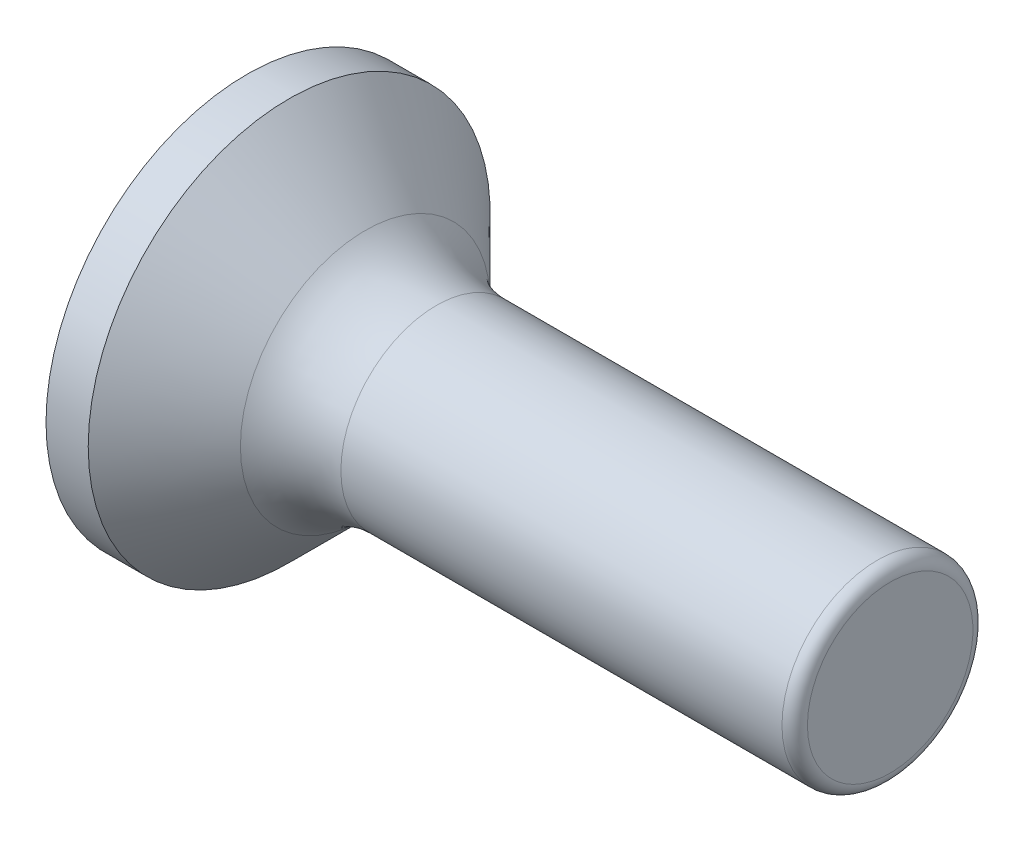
ISO-10303-21;
HEADER;
FILE_DESCRIPTION(('STEP AP214'),'2;1');
FILE_NAME('part.step','',(''),(''),'','','');
FILE_SCHEMA(('AUTOMOTIVE_DESIGN { 1 0 10303 214 1 1 1 1 }'));
ENDSEC;
DATA;
#1=APPLICATION_CONTEXT('core data for automotive mechanical design processes');
#2=APPLICATION_PROTOCOL_DEFINITION('international standard','automotive_design',2000,#1);
#3=PRODUCT_CONTEXT('',#1,'mechanical');
#4=PRODUCT('Part','Part','',(#3));
#5=PRODUCT_RELATED_PRODUCT_CATEGORY('part','',(#4));
#6=PRODUCT_DEFINITION_FORMATION('','',#4);
#7=PRODUCT_DEFINITION_CONTEXT('part definition',#1,'design');
#8=PRODUCT_DEFINITION('design','',#6,#7);
#9=PRODUCT_DEFINITION_SHAPE('','',#8);
#10=(LENGTH_UNIT() NAMED_UNIT(*) SI_UNIT(.MILLI.,.METRE.));
#11=(NAMED_UNIT(*) PLANE_ANGLE_UNIT() SI_UNIT($,.RADIAN.));
#12=(NAMED_UNIT(*) SI_UNIT($,.STERADIAN.) SOLID_ANGLE_UNIT());
#13=UNCERTAINTY_MEASURE_WITH_UNIT(LENGTH_MEASURE(1.E-05),#10,'distance_accuracy_value','');
#14=(GEOMETRIC_REPRESENTATION_CONTEXT(3) GLOBAL_UNCERTAINTY_ASSIGNED_CONTEXT((#13)) GLOBAL_UNIT_ASSIGNED_CONTEXT((#10,
#11,#12)) REPRESENTATION_CONTEXT('',''));
#15=CARTESIAN_POINT('',(0.,0.,0.));
#16=DIRECTION('',(0.,0.,1.));
#17=DIRECTION('',(1.,0.,0.));
#18=AXIS2_PLACEMENT_3D('',#15,#16,#17);
#19=CARTESIAN_POINT('',(0.,10.,0.));
#20=DIRECTION('',(1.,0.,0.));
#21=DIRECTION('',(0.,0.,-1.));
#22=AXIS2_PLACEMENT_3D('',#19,#20,#21);
#23=PLANE('',#22);
#24=CARTESIAN_POINT('',(0.,0.,0.));
#25=DIRECTION('',(-1.,0.,0.));
#26=DIRECTION('',(0.,0.,1.));
#27=AXIS2_PLACEMENT_3D('',#24,#25,#26);
#28=CIRCLE('',#27,10.);
#29=CARTESIAN_POINT('',(0.,0.,10.));
#30=VERTEX_POINT('',#29);
#31=EDGE_CURVE('E182',#30,#30,#28,.T.);
#32=ORIENTED_EDGE('',*,*,#31,.T.);
#33=EDGE_LOOP('',(#32));
#34=FACE_BOUND('',#33,.T.);
#35=DIRECTION('',(0.,-1.,0.));
#36=VECTOR('',#35,1.);
#37=CARTESIAN_POINT('',(0.,5.,1.));
#38=LINE('',#37,#36);
#39=CARTESIAN_POINT('',(0.,5.,1.));
#40=VERTEX_POINT('',#39);
#41=CARTESIAN_POINT('',(0.,1.,1.));
#42=VERTEX_POINT('',#41);
#43=EDGE_CURVE('E54',#40,#42,#38,.T.);
#44=ORIENTED_EDGE('',*,*,#43,.T.);
#45=DIRECTION('',(0.,0.,1.));
#46=VECTOR('',#45,1.);
#47=CARTESIAN_POINT('',(0.,1.,1.));
#48=LINE('',#47,#46);
#49=CARTESIAN_POINT('',(0.,1.,5.));
#50=VERTEX_POINT('',#49);
#51=EDGE_CURVE('E271',#42,#50,#48,.T.);
#52=ORIENTED_EDGE('',*,*,#51,.T.);
#53=DIRECTION('',(0.,-1.,0.));
#54=VECTOR('',#53,1.);
#55=CARTESIAN_POINT('',(0.,1.,5.));
#56=LINE('',#55,#54);
#57=CARTESIAN_POINT('',(0.,-1.,5.));
#58=VERTEX_POINT('',#57);
#59=EDGE_CURVE('E273',#50,#58,#56,.T.);
#60=ORIENTED_EDGE('',*,*,#59,.T.);
#61=DIRECTION('',(0.,0.,-1.));
#62=VECTOR('',#61,1.);
#63=CARTESIAN_POINT('',(0.,-1.,1.));
#64=LINE('',#63,#62);
#65=CARTESIAN_POINT('',(0.,-1.,1.));
#66=VERTEX_POINT('',#65);
#67=EDGE_CURVE('E279',#58,#66,#64,.T.);
#68=ORIENTED_EDGE('',*,*,#67,.T.);
#69=DIRECTION('',(0.,-1.,0.));
#70=VECTOR('',#69,1.);
#71=CARTESIAN_POINT('',(0.,-5.,1.));
#72=LINE('',#71,#70);
#73=CARTESIAN_POINT('',(0.,-5.,1.));
#74=VERTEX_POINT('',#73);
#75=EDGE_CURVE('E282',#66,#74,#72,.T.);
#76=ORIENTED_EDGE('',*,*,#75,.T.);
#77=DIRECTION('',(0.,0.,-1.));
#78=VECTOR('',#77,1.);
#79=CARTESIAN_POINT('',(0.,-5.,-1.));
#80=LINE('',#79,#78);
#81=CARTESIAN_POINT('',(0.,-5.,-1.));
#82=VERTEX_POINT('',#81);
#83=EDGE_CURVE('E285',#74,#82,#80,.T.);
#84=ORIENTED_EDGE('',*,*,#83,.T.);
#85=DIRECTION('',(0.,1.,0.));
#86=VECTOR('',#85,1.);
#87=CARTESIAN_POINT('',(0.,-5.,-1.));
#88=LINE('',#87,#86);
#89=CARTESIAN_POINT('',(0.,-1.,-1.));
#90=VERTEX_POINT('',#89);
#91=EDGE_CURVE('E288',#82,#90,#88,.T.);
#92=ORIENTED_EDGE('',*,*,#91,.T.);
#93=DIRECTION('',(0.,0.,-1.));
#94=VECTOR('',#93,1.);
#95=CARTESIAN_POINT('',(0.,-1.,-1.));
#96=LINE('',#95,#94);
#97=CARTESIAN_POINT('',(0.,-1.,-5.));
#98=VERTEX_POINT('',#97);
#99=EDGE_CURVE('E162',#90,#98,#96,.T.);
#100=ORIENTED_EDGE('',*,*,#99,.T.);
#101=DIRECTION('',(0.,1.,0.));
#102=VECTOR('',#101,1.);
#103=CARTESIAN_POINT('',(0.,1.,-5.));
#104=LINE('',#103,#102);
#105=CARTESIAN_POINT('',(0.,1.,-5.));
#106=VERTEX_POINT('',#105);
#107=EDGE_CURVE('E160',#98,#106,#104,.T.);
#108=ORIENTED_EDGE('',*,*,#107,.T.);
#109=DIRECTION('',(0.,0.,1.));
#110=VECTOR('',#109,1.);
#111=CARTESIAN_POINT('',(0.,1.,-1.));
#112=LINE('',#111,#110);
#113=CARTESIAN_POINT('',(0.,1.,-1.));
#114=VERTEX_POINT('',#113);
#115=EDGE_CURVE('E140',#106,#114,#112,.T.);
#116=ORIENTED_EDGE('',*,*,#115,.T.);
#117=DIRECTION('',(0.,1.,0.));
#118=VECTOR('',#117,1.);
#119=CARTESIAN_POINT('',(0.,5.,-1.));
#120=LINE('',#119,#118);
#121=CARTESIAN_POINT('',(0.,5.,-1.));
#122=VERTEX_POINT('',#121);
#123=EDGE_CURVE('E150',#114,#122,#120,.T.);
#124=ORIENTED_EDGE('',*,*,#123,.T.);
#125=DIRECTION('',(0.,0.,1.));
#126=VECTOR('',#125,1.);
#127=CARTESIAN_POINT('',(0.,5.,-1.));
#128=LINE('',#127,#126);
#129=EDGE_CURVE('E156',#122,#40,#128,.T.);
#130=ORIENTED_EDGE('',*,*,#129,.T.);
#131=EDGE_LOOP('',(#44,#52,#60,#68,#76,#84,#92,#100,#108,#116,#124,#130));
#132=FACE_BOUND('',#131,.T.);
#133=ADVANCED_FACE('F37',(#34,#132),#23,.F.);
#134=CARTESIAN_POINT('',(9.42106781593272,0.,0.));
#135=DIRECTION('',(-1.,0.,0.));
#136=DIRECTION('',(0.,0.,1.));
#137=AXIS2_PLACEMENT_3D('',#134,#135,#136);
#138=TOROIDAL_SURFACE('',#137,9.75,5.00000000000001);
#139=CARTESIAN_POINT('',(5.88553391,0.,0.));
#140=DIRECTION('',(-1.,0.,0.));
#141=DIRECTION('',(0.,0.,1.));
#142=AXIS2_PLACEMENT_3D('',#139,#140,#141);
#143=CIRCLE('',#142,6.21446609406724);
#144=CARTESIAN_POINT('',(5.88553391,0.,6.21446609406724));
#145=VERTEX_POINT('',#144);
#146=EDGE_CURVE('E188',#145,#145,#143,.T.);
#147=ORIENTED_EDGE('',*,*,#146,.F.);
#148=EDGE_LOOP('',(#147));
#149=FACE_BOUND('',#148,.T.);
#150=CARTESIAN_POINT('',(9.42106781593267,0.,0.));
#151=DIRECTION('',(-1.,0.,0.));
#152=DIRECTION('',(0.,0.,1.));
#153=AXIS2_PLACEMENT_3D('',#150,#151,#152);
#154=CIRCLE('',#153,4.74999999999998);
#155=CARTESIAN_POINT('',(9.42106781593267,0.,4.74999999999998));
#156=VERTEX_POINT('',#155);
#157=EDGE_CURVE('E178',#156,#156,#154,.T.);
#158=ORIENTED_EDGE('',*,*,#157,.T.);
#159=EDGE_LOOP('',(#158));
#160=FACE_BOUND('',#159,.T.);
#161=ADVANCED_FACE('F227',(#149,#160),#138,.F.);
#162=CARTESIAN_POINT('',(5.88553391,0.,0.));
#163=DIRECTION('',(-1.,0.,0.));
#164=DIRECTION('',(0.,0.,1.));
#165=AXIS2_PLACEMENT_3D('',#162,#163,#164);
#166=CONICAL_SURFACE('',#165,6.21446609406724,0.785398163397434);
#167=CARTESIAN_POINT('',(2.10000000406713,0.,0.));
#168=DIRECTION('',(-1.,0.,0.));
#169=DIRECTION('',(0.,0.,1.));
#170=AXIS2_PLACEMENT_3D('',#167,#168,#169);
#171=CIRCLE('',#170,10.);
#172=CARTESIAN_POINT('',(2.10000000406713,0.,10.));
#173=VERTEX_POINT('',#172);
#174=EDGE_CURVE('E185',#173,#173,#171,.T.);
#175=ORIENTED_EDGE('',*,*,#174,.F.);
#176=EDGE_LOOP('',(#175));
#177=FACE_BOUND('',#176,.T.);
#178=ORIENTED_EDGE('',*,*,#146,.T.);
#179=EDGE_LOOP('',(#178));
#180=FACE_BOUND('',#179,.T.);
#181=ADVANCED_FACE('F233',(#177,#180),#166,.T.);
#182=CARTESIAN_POINT('',(-11.6961475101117,0.,0.));
#183=DIRECTION('',(-1.,0.,0.));
#184=DIRECTION('',(0.,0.,1.));
#185=AXIS2_PLACEMENT_3D('',#182,#183,#184);
#186=CYLINDRICAL_SURFACE('',#185,10.);
#187=ORIENTED_EDGE('',*,*,#31,.F.);
#188=EDGE_LOOP('',(#187));
#189=FACE_BOUND('',#188,.T.);
#190=ORIENTED_EDGE('',*,*,#174,.T.);
#191=EDGE_LOOP('',(#190));
#192=FACE_BOUND('',#191,.T.);
#193=ADVANCED_FACE('F240',(#189,#192),#186,.T.);
#194=CARTESIAN_POINT('',(32.,0.,0.));
#195=DIRECTION('',(-1.,0.,0.));
#196=DIRECTION('',(0.,0.,1.));
#197=AXIS2_PLACEMENT_3D('',#194,#195,#196);
#198=PLANE('',#197);
#199=CARTESIAN_POINT('',(32.,0.,0.));
#200=DIRECTION('',(-1.,0.,0.));
#201=DIRECTION('',(0.,0.,1.));
#202=AXIS2_PLACEMENT_3D('',#199,#200,#201);
#203=CIRCLE('',#202,4.11666666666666);
#204=CARTESIAN_POINT('',(32.,0.,4.11666666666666));
#205=VERTEX_POINT('',#204);
#206=EDGE_CURVE('E11',#205,#205,#203,.F.);
#207=ORIENTED_EDGE('',*,*,#206,.T.);
#208=EDGE_LOOP('',(#207));
#209=FACE_BOUND('',#208,.T.);
#210=ADVANCED_FACE('F238',(#209),#198,.F.);
#211=CARTESIAN_POINT('',(-11.6961475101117,0.,0.));
#212=DIRECTION('',(-1.,0.,0.));
#213=DIRECTION('',(0.,0.,1.));
#214=AXIS2_PLACEMENT_3D('',#211,#212,#213);
#215=CYLINDRICAL_SURFACE('',#214,4.74999999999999);
#216=CARTESIAN_POINT('',(31.3666666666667,0.,0.));
#217=DIRECTION('',(-1.,0.,0.));
#218=DIRECTION('',(0.,0.,1.));
#219=AXIS2_PLACEMENT_3D('',#216,#217,#218);
#220=CIRCLE('',#219,4.74999999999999);
#221=CARTESIAN_POINT('',(31.3666666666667,0.,4.74999999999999));
#222=VERTEX_POINT('',#221);
#223=EDGE_CURVE('E46',#222,#222,#220,.T.);
#224=ORIENTED_EDGE('',*,*,#223,.T.);
#225=EDGE_LOOP('',(#224));
#226=FACE_BOUND('',#225,.T.);
#227=ORIENTED_EDGE('',*,*,#157,.F.);
#228=EDGE_LOOP('',(#227));
#229=FACE_BOUND('',#228,.T.);
#230=ADVANCED_FACE('F214',(#226,#229),#215,.T.);
#231=CARTESIAN_POINT('',(2.942766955,5.,1.));
#232=DIRECTION('',(0.,0.,-1.));
#233=DIRECTION('',(-1.,0.,0.));
#234=AXIS2_PLACEMENT_3D('',#231,#232,#233);
#235=PLANE('',#234);
#236=ORIENTED_EDGE('',*,*,#43,.F.);
#237=DIRECTION('',(-0.866025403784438,0.500000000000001,0.));
#238=VECTOR('',#237,1.);
#239=CARTESIAN_POINT('',(2.20707521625,3.72574452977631,1.));
#240=LINE('',#239,#238);
#241=CARTESIAN_POINT('',(2.942766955,3.30099270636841,1.));
#242=VERTEX_POINT('',#241);
#243=EDGE_CURVE('E196',#242,#40,#240,.T.);
#244=ORIENTED_EDGE('',*,*,#243,.F.);
#245=DIRECTION('',(0.,-1.,0.));
#246=VECTOR('',#245,1.);
#247=CARTESIAN_POINT('',(2.942766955,5.,1.));
#248=LINE('',#247,#246);
#249=CARTESIAN_POINT('',(2.942766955,1.,1.));
#250=VERTEX_POINT('',#249);
#251=EDGE_CURVE('E166',#242,#250,#248,.T.);
#252=ORIENTED_EDGE('',*,*,#251,.T.);
#253=DIRECTION('',(-1.,0.,0.));
#254=VECTOR('',#253,1.);
#255=CARTESIAN_POINT('',(2.942766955,1.,1.));
#256=LINE('',#255,#254);
#257=EDGE_CURVE('E176',#250,#42,#256,.T.);
#258=ORIENTED_EDGE('',*,*,#257,.T.);
#259=EDGE_LOOP('',(#236,#244,#252,#258));
#260=FACE_BOUND('',#259,.T.);
#261=ADVANCED_FACE('F303',(#260),#235,.T.);
#262=CARTESIAN_POINT('',(2.942766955,1.,1.));
#263=DIRECTION('',(0.,-1.,0.));
#264=DIRECTION('',(0.,0.,-1.));
#265=AXIS2_PLACEMENT_3D('',#262,#263,#264);
#266=PLANE('',#265);
#267=ORIENTED_EDGE('',*,*,#51,.F.);
#268=ORIENTED_EDGE('',*,*,#257,.F.);
#269=DIRECTION('',(0.,0.,1.));
#270=VECTOR('',#269,1.);
#271=CARTESIAN_POINT('',(2.942766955,1.,1.));
#272=LINE('',#271,#270);
#273=CARTESIAN_POINT('',(2.942766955,1.,3.30099270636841));
#274=VERTEX_POINT('',#273);
#275=EDGE_CURVE('E95',#250,#274,#272,.T.);
#276=ORIENTED_EDGE('',*,*,#275,.T.);
#277=DIRECTION('',(-0.866025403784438,0.,0.500000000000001));
#278=VECTOR('',#277,1.);
#279=CARTESIAN_POINT('',(0.,1.,5.));
#280=LINE('',#279,#278);
#281=EDGE_CURVE('E179',#274,#50,#280,.T.);
#282=ORIENTED_EDGE('',*,*,#281,.T.);
#283=EDGE_LOOP('',(#267,#268,#276,#282));
#284=FACE_BOUND('',#283,.T.);
#285=ADVANCED_FACE('F256',(#284),#266,.T.);
#286=CARTESIAN_POINT('',(0.,1.,5.));
#287=DIRECTION('',(-0.500000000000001,0.,-0.866025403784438));
#288=DIRECTION('',(-0.866025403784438,0.,0.500000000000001));
#289=AXIS2_PLACEMENT_3D('',#286,#287,#288);
#290=PLANE('',#289);
#291=ORIENTED_EDGE('',*,*,#59,.F.);
#292=ORIENTED_EDGE('',*,*,#281,.F.);
#293=DIRECTION('',(0.,-1.,0.));
#294=VECTOR('',#293,1.);
#295=CARTESIAN_POINT('',(2.942766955,1.,3.30099270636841));
#296=LINE('',#295,#294);
#297=CARTESIAN_POINT('',(2.942766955,-1.,3.30099270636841));
#298=VERTEX_POINT('',#297);
#299=EDGE_CURVE('E85',#274,#298,#296,.T.);
#300=ORIENTED_EDGE('',*,*,#299,.T.);
#301=DIRECTION('',(-0.866025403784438,0.,0.500000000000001));
#302=VECTOR('',#301,1.);
#303=CARTESIAN_POINT('',(3.93912602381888,-1.,2.7257445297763));
#304=LINE('',#303,#302);
#305=EDGE_CURVE('E174',#298,#58,#304,.T.);
#306=ORIENTED_EDGE('',*,*,#305,.T.);
#307=EDGE_LOOP('',(#291,#292,#300,#306));
#308=FACE_BOUND('',#307,.T.);
#309=ADVANCED_FACE('F252',(#308),#290,.T.);
#310=CARTESIAN_POINT('',(2.942766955,-1.,1.));
#311=DIRECTION('',(0.,1.,0.));
#312=DIRECTION('',(0.,0.,1.));
#313=AXIS2_PLACEMENT_3D('',#310,#311,#312);
#314=PLANE('',#313);
#315=ORIENTED_EDGE('',*,*,#67,.F.);
#316=ORIENTED_EDGE('',*,*,#305,.F.);
#317=DIRECTION('',(0.,0.,-1.));
#318=VECTOR('',#317,1.);
#319=CARTESIAN_POINT('',(2.942766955,-1.,1.));
#320=LINE('',#319,#318);
#321=CARTESIAN_POINT('',(2.942766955,-1.,1.));
#322=VERTEX_POINT('',#321);
#323=EDGE_CURVE('E210',#298,#322,#320,.T.);
#324=ORIENTED_EDGE('',*,*,#323,.T.);
#325=DIRECTION('',(-1.,0.,0.));
#326=VECTOR('',#325,1.);
#327=CARTESIAN_POINT('',(2.942766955,-1.,1.));
#328=LINE('',#327,#326);
#329=EDGE_CURVE('E172',#322,#66,#328,.T.);
#330=ORIENTED_EDGE('',*,*,#329,.T.);
#331=EDGE_LOOP('',(#315,#316,#324,#330));
#332=FACE_BOUND('',#331,.T.);
#333=ADVANCED_FACE('F255',(#332),#314,.T.);
#334=CARTESIAN_POINT('',(2.942766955,-5.,1.));
#335=DIRECTION('',(0.,0.,-1.));
#336=DIRECTION('',(-1.,0.,0.));
#337=AXIS2_PLACEMENT_3D('',#334,#335,#336);
#338=PLANE('',#337);
#339=ORIENTED_EDGE('',*,*,#75,.F.);
#340=ORIENTED_EDGE('',*,*,#329,.F.);
#341=DIRECTION('',(0.,-1.,0.));
#342=VECTOR('',#341,1.);
#343=CARTESIAN_POINT('',(2.942766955,-5.,1.));
#344=LINE('',#343,#342);
#345=CARTESIAN_POINT('',(2.942766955,-3.30099270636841,1.));
#346=VERTEX_POINT('',#345);
#347=EDGE_CURVE('E206',#322,#346,#344,.T.);
#348=ORIENTED_EDGE('',*,*,#347,.T.);
#349=DIRECTION('',(-0.866025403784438,-0.500000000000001,0.));
#350=VECTOR('',#349,1.);
#351=CARTESIAN_POINT('',(0.,-5.,1.));
#352=LINE('',#351,#350);
#353=EDGE_CURVE('E175',#346,#74,#352,.T.);
#354=ORIENTED_EDGE('',*,*,#353,.T.);
#355=EDGE_LOOP('',(#339,#340,#348,#354));
#356=FACE_BOUND('',#355,.T.);
#357=ADVANCED_FACE('F260',(#356),#338,.T.);
#358=CARTESIAN_POINT('',(0.,-5.,-1.));
#359=DIRECTION('',(-0.500000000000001,0.866025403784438,0.));
#360=DIRECTION('',(-0.866025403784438,-0.500000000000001,0.));
#361=AXIS2_PLACEMENT_3D('',#358,#359,#360);
#362=PLANE('',#361);
#363=ORIENTED_EDGE('',*,*,#83,.F.);
#364=ORIENTED_EDGE('',*,*,#353,.F.);
#365=DIRECTION('',(0.,0.,-1.));
#366=VECTOR('',#365,1.);
#367=CARTESIAN_POINT('',(2.942766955,-3.30099270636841,1.));
#368=LINE('',#367,#366);
#369=CARTESIAN_POINT('',(2.942766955,-3.30099270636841,-1.));
#370=VERTEX_POINT('',#369);
#371=EDGE_CURVE('E203',#346,#370,#368,.T.);
#372=ORIENTED_EDGE('',*,*,#371,.T.);
#373=DIRECTION('',(-0.866025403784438,-0.500000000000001,0.));
#374=VECTOR('',#373,1.);
#375=CARTESIAN_POINT('',(2.20707521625,-3.72574452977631,-1.));
#376=LINE('',#375,#374);
#377=EDGE_CURVE('E170',#370,#82,#376,.T.);
#378=ORIENTED_EDGE('',*,*,#377,.T.);
#379=EDGE_LOOP('',(#363,#364,#372,#378));
#380=FACE_BOUND('',#379,.T.);
#381=ADVANCED_FACE('F257',(#380),#362,.T.);
#382=CARTESIAN_POINT('',(2.942766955,-5.,-1.));
#383=DIRECTION('',(0.,0.,1.));
#384=DIRECTION('',(0.,-1.,0.));
#385=AXIS2_PLACEMENT_3D('',#382,#383,#384);
#386=PLANE('',#385);
#387=ORIENTED_EDGE('',*,*,#91,.F.);
#388=ORIENTED_EDGE('',*,*,#377,.F.);
#389=DIRECTION('',(0.,1.,0.));
#390=VECTOR('',#389,1.);
#391=CARTESIAN_POINT('',(2.942766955,-5.,-1.));
#392=LINE('',#391,#390);
#393=CARTESIAN_POINT('',(2.942766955,-1.,-1.));
#394=VERTEX_POINT('',#393);
#395=EDGE_CURVE('E205',#370,#394,#392,.T.);
#396=ORIENTED_EDGE('',*,*,#395,.T.);
#397=DIRECTION('',(-1.,0.,0.));
#398=VECTOR('',#397,1.);
#399=CARTESIAN_POINT('',(2.942766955,-1.,-1.));
#400=LINE('',#399,#398);
#401=EDGE_CURVE('E168',#394,#90,#400,.T.);
#402=ORIENTED_EDGE('',*,*,#401,.T.);
#403=EDGE_LOOP('',(#387,#388,#396,#402));
#404=FACE_BOUND('',#403,.T.);
#405=ADVANCED_FACE('F259',(#404),#386,.T.);
#406=CARTESIAN_POINT('',(2.942766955,-1.,-1.));
#407=DIRECTION('',(0.,1.,0.));
#408=DIRECTION('',(0.,0.,1.));
#409=AXIS2_PLACEMENT_3D('',#406,#407,#408);
#410=PLANE('',#409);
#411=ORIENTED_EDGE('',*,*,#99,.F.);
#412=ORIENTED_EDGE('',*,*,#401,.F.);
#413=DIRECTION('',(0.,0.,-1.));
#414=VECTOR('',#413,1.);
#415=CARTESIAN_POINT('',(2.942766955,-1.,-1.));
#416=LINE('',#415,#414);
#417=CARTESIAN_POINT('',(2.942766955,-1.,-3.30099270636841));
#418=VERTEX_POINT('',#417);
#419=EDGE_CURVE('E194',#394,#418,#416,.T.);
#420=ORIENTED_EDGE('',*,*,#419,.T.);
#421=DIRECTION('',(-0.866025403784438,0.,-0.500000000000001));
#422=VECTOR('',#421,1.);
#423=CARTESIAN_POINT('',(0.,-1.,-5.));
#424=LINE('',#423,#422);
#425=EDGE_CURVE('E171',#418,#98,#424,.T.);
#426=ORIENTED_EDGE('',*,*,#425,.T.);
#427=EDGE_LOOP('',(#411,#412,#420,#426));
#428=FACE_BOUND('',#427,.T.);
#429=ADVANCED_FACE('F250',(#428),#410,.T.);
#430=CARTESIAN_POINT('',(0.,1.,-5.));
#431=DIRECTION('',(-0.500000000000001,0.,0.866025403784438));
#432=DIRECTION('',(0.866025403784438,0.,0.500000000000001));
#433=AXIS2_PLACEMENT_3D('',#430,#431,#432);
#434=PLANE('',#433);
#435=ORIENTED_EDGE('',*,*,#107,.F.);
#436=ORIENTED_EDGE('',*,*,#425,.F.);
#437=DIRECTION('',(0.,1.,0.));
#438=VECTOR('',#437,1.);
#439=CARTESIAN_POINT('',(2.942766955,1.,-3.30099270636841));
#440=LINE('',#439,#438);
#441=CARTESIAN_POINT('',(2.942766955,1.,-3.30099270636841));
#442=VERTEX_POINT('',#441);
#443=EDGE_CURVE('E192',#418,#442,#440,.T.);
#444=ORIENTED_EDGE('',*,*,#443,.T.);
#445=DIRECTION('',(-0.866025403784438,0.,-0.500000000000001));
#446=VECTOR('',#445,1.);
#447=CARTESIAN_POINT('',(3.93912602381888,1.,-2.72574452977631));
#448=LINE('',#447,#446);
#449=EDGE_CURVE('E146',#442,#106,#448,.T.);
#450=ORIENTED_EDGE('',*,*,#449,.T.);
#451=EDGE_LOOP('',(#435,#436,#444,#450));
#452=FACE_BOUND('',#451,.T.);
#453=ADVANCED_FACE('F247',(#452),#434,.T.);
#454=CARTESIAN_POINT('',(2.942766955,1.,-1.));
#455=DIRECTION('',(0.,-1.,0.));
#456=DIRECTION('',(0.,0.,-1.));
#457=AXIS2_PLACEMENT_3D('',#454,#455,#456);
#458=PLANE('',#457);
#459=ORIENTED_EDGE('',*,*,#115,.F.);
#460=ORIENTED_EDGE('',*,*,#449,.F.);
#461=DIRECTION('',(0.,0.,1.));
#462=VECTOR('',#461,1.);
#463=CARTESIAN_POINT('',(2.942766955,1.,-1.));
#464=LINE('',#463,#462);
#465=CARTESIAN_POINT('',(2.942766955,1.,-1.));
#466=VERTEX_POINT('',#465);
#467=EDGE_CURVE('E143',#442,#466,#464,.T.);
#468=ORIENTED_EDGE('',*,*,#467,.T.);
#469=DIRECTION('',(-1.,0.,0.));
#470=VECTOR('',#469,1.);
#471=CARTESIAN_POINT('',(2.942766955,1.,-1.));
#472=LINE('',#471,#470);
#473=EDGE_CURVE('E135',#466,#114,#472,.T.);
#474=ORIENTED_EDGE('',*,*,#473,.T.);
#475=EDGE_LOOP('',(#459,#460,#468,#474));
#476=FACE_BOUND('',#475,.T.);
#477=ADVANCED_FACE('F137',(#476),#458,.T.);
#478=CARTESIAN_POINT('',(2.942766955,5.,-1.));
#479=DIRECTION('',(0.,0.,1.));
#480=DIRECTION('',(0.,-1.,0.));
#481=AXIS2_PLACEMENT_3D('',#478,#479,#480);
#482=PLANE('',#481);
#483=ORIENTED_EDGE('',*,*,#123,.F.);
#484=ORIENTED_EDGE('',*,*,#473,.F.);
#485=DIRECTION('',(0.,1.,0.));
#486=VECTOR('',#485,1.);
#487=CARTESIAN_POINT('',(2.942766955,5.,-1.));
#488=LINE('',#487,#486);
#489=CARTESIAN_POINT('',(2.942766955,3.30099270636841,-1.));
#490=VERTEX_POINT('',#489);
#491=EDGE_CURVE('E200',#466,#490,#488,.T.);
#492=ORIENTED_EDGE('',*,*,#491,.T.);
#493=DIRECTION('',(-0.866025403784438,0.500000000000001,0.));
#494=VECTOR('',#493,1.);
#495=CARTESIAN_POINT('',(0.,5.,-1.));
#496=LINE('',#495,#494);
#497=EDGE_CURVE('E147',#490,#122,#496,.T.);
#498=ORIENTED_EDGE('',*,*,#497,.T.);
#499=EDGE_LOOP('',(#483,#484,#492,#498));
#500=FACE_BOUND('',#499,.T.);
#501=ADVANCED_FACE('F151',(#500),#482,.T.);
#502=CARTESIAN_POINT('',(0.,5.,-1.));
#503=DIRECTION('',(-0.500000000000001,-0.866025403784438,0.));
#504=DIRECTION('',(0.866025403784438,-0.500000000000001,0.));
#505=AXIS2_PLACEMENT_3D('',#502,#503,#504);
#506=PLANE('',#505);
#507=ORIENTED_EDGE('',*,*,#129,.F.);
#508=ORIENTED_EDGE('',*,*,#497,.F.);
#509=DIRECTION('',(0.,0.,1.));
#510=VECTOR('',#509,1.);
#511=CARTESIAN_POINT('',(2.942766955,3.30099270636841,1.));
#512=LINE('',#511,#510);
#513=EDGE_CURVE('E198',#490,#242,#512,.T.);
#514=ORIENTED_EDGE('',*,*,#513,.T.);
#515=ORIENTED_EDGE('',*,*,#243,.T.);
#516=EDGE_LOOP('',(#507,#508,#514,#515));
#517=FACE_BOUND('',#516,.T.);
#518=ADVANCED_FACE('F223',(#517),#506,.T.);
#519=CARTESIAN_POINT('',(2.942766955,1.,1.));
#520=DIRECTION('',(-1.,0.,0.));
#521=DIRECTION('',(0.,0.,1.));
#522=AXIS2_PLACEMENT_3D('',#519,#520,#521);
#523=PLANE('',#522);
#524=ORIENTED_EDGE('',*,*,#251,.F.);
#525=ORIENTED_EDGE('',*,*,#513,.F.);
#526=ORIENTED_EDGE('',*,*,#491,.F.);
#527=ORIENTED_EDGE('',*,*,#467,.F.);
#528=ORIENTED_EDGE('',*,*,#443,.F.);
#529=ORIENTED_EDGE('',*,*,#419,.F.);
#530=ORIENTED_EDGE('',*,*,#395,.F.);
#531=ORIENTED_EDGE('',*,*,#371,.F.);
#532=ORIENTED_EDGE('',*,*,#347,.F.);
#533=ORIENTED_EDGE('',*,*,#323,.F.);
#534=ORIENTED_EDGE('',*,*,#299,.F.);
#535=ORIENTED_EDGE('',*,*,#275,.F.);
#536=EDGE_LOOP('',(#524,#525,#526,#527,#528,#529,#530,#531,#532,#533,#534,#535));
#537=FACE_BOUND('',#536,.T.);
#538=ADVANCED_FACE('F218',(#537),#523,.T.);
#539=CARTESIAN_POINT('',(31.3666666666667,0.,0.));
#540=DIRECTION('',(-1.,0.,0.));
#541=DIRECTION('',(0.,0.,1.));
#542=AXIS2_PLACEMENT_3D('',#539,#540,#541);
#543=TOROIDAL_SURFACE('',#542,4.11666666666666,0.633333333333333);
#544=ORIENTED_EDGE('',*,*,#206,.F.);
#545=EDGE_LOOP('',(#544));
#546=FACE_BOUND('',#545,.T.);
#547=ORIENTED_EDGE('',*,*,#223,.F.);
#548=EDGE_LOOP('',(#547));
#549=FACE_BOUND('',#548,.T.);
#550=ADVANCED_FACE('F39',(#546,#549),#543,.T.);
#551=CLOSED_SHELL('',(#133,#161,#181,#193,#210,#230,#261,#285,#309,#333,#357,#381,#405,#429,
#453,#477,#501,#518,#538,#550));
#552=MANIFOLD_SOLID_BREP('B2',#551);
#553=ADVANCED_BREP_SHAPE_REPRESENTATION('',(#18,#552),#14);
#554=SHAPE_DEFINITION_REPRESENTATION(#9,#553);
ENDSEC;
END-ISO-10303-21;
